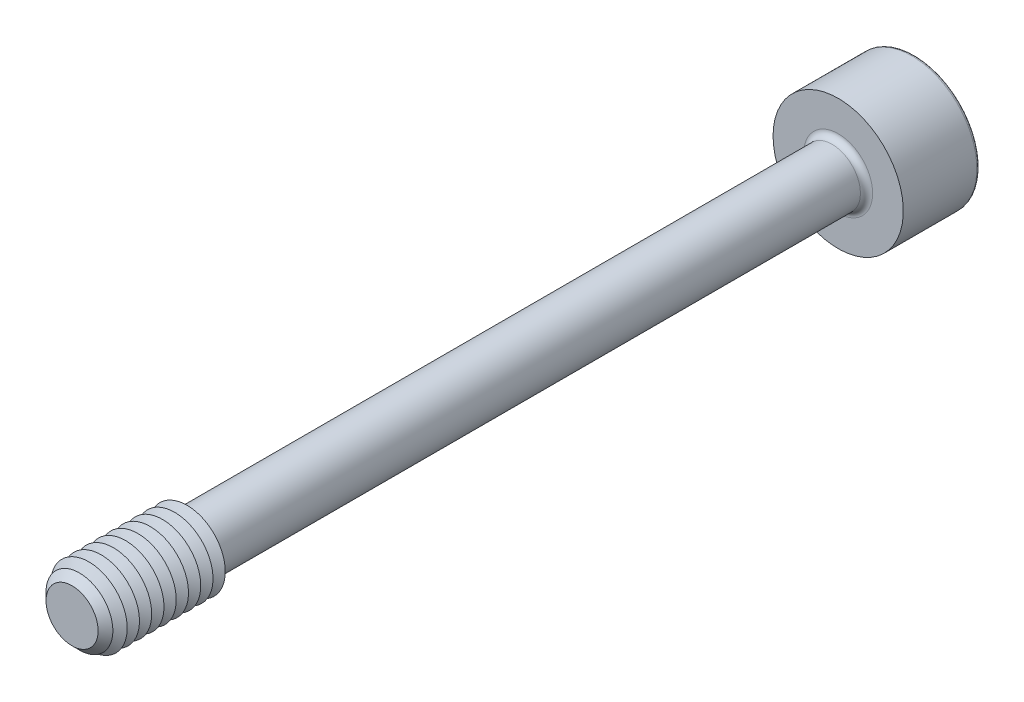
ISO-10303-21;
HEADER;
FILE_DESCRIPTION(('STEP AP214'),'2;1');
FILE_NAME('part.step','',(''),(''),'','','');
FILE_SCHEMA(('AUTOMOTIVE_DESIGN { 1 0 10303 214 1 1 1 1 }'));
ENDSEC;
DATA;
#1=APPLICATION_CONTEXT('core data for automotive mechanical design processes');
#2=APPLICATION_PROTOCOL_DEFINITION('international standard','automotive_design',2000,#1);
#3=PRODUCT_CONTEXT('',#1,'mechanical');
#4=PRODUCT('Part','Part','',(#3));
#5=PRODUCT_RELATED_PRODUCT_CATEGORY('part','',(#4));
#6=PRODUCT_DEFINITION_FORMATION('','',#4);
#7=PRODUCT_DEFINITION_CONTEXT('part definition',#1,'design');
#8=PRODUCT_DEFINITION('design','',#6,#7);
#9=PRODUCT_DEFINITION_SHAPE('','',#8);
#10=(LENGTH_UNIT() NAMED_UNIT(*) SI_UNIT(.MILLI.,.METRE.));
#11=(NAMED_UNIT(*) PLANE_ANGLE_UNIT() SI_UNIT($,.RADIAN.));
#12=(NAMED_UNIT(*) SI_UNIT($,.STERADIAN.) SOLID_ANGLE_UNIT());
#13=UNCERTAINTY_MEASURE_WITH_UNIT(LENGTH_MEASURE(1.E-05),#10,'distance_accuracy_value','');
#14=(GEOMETRIC_REPRESENTATION_CONTEXT(3) GLOBAL_UNCERTAINTY_ASSIGNED_CONTEXT((#13)) GLOBAL_UNIT_ASSIGNED_CONTEXT((#10,
#11,#12)) REPRESENTATION_CONTEXT('',''));
#15=CARTESIAN_POINT('',(0.,0.,0.));
#16=DIRECTION('',(0.,0.,1.));
#17=DIRECTION('',(1.,0.,0.));
#18=AXIS2_PLACEMENT_3D('',#15,#16,#17);
#19=CARTESIAN_POINT('',(-1.15470053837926,-2.,-26.));
#20=DIRECTION('',(0.,0.,1.));
#21=DIRECTION('',(1.,0.,0.));
#22=AXIS2_PLACEMENT_3D('',#19,#20,#21);
#23=PLANE('',#22);
#24=DIRECTION('',(1.,0.,0.));
#25=VECTOR('',#24,1.);
#26=CARTESIAN_POINT('',(-1.15470053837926,-2.,-26.));
#27=LINE('',#26,#25);
#28=CARTESIAN_POINT('',(0.,-2.,-26.));
#29=VERTEX_POINT('',#28);
#30=CARTESIAN_POINT('',(1.15470053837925,-2.,-26.));
#31=VERTEX_POINT('',#30);
#32=EDGE_CURVE('E796',#29,#31,#27,.T.);
#33=ORIENTED_EDGE('',*,*,#32,.F.);
#34=CARTESIAN_POINT('',(0.,0.,-26.));
#35=DIRECTION('',(0.,0.,1.));
#36=DIRECTION('',(0.,-1.,0.));
#37=AXIS2_PLACEMENT_3D('',#34,#35,#36);
#38=CIRCLE('',#37,2.);
#39=CARTESIAN_POINT('',(1.73205080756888,-0.999999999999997,-26.));
#40=VERTEX_POINT('',#39);
#41=EDGE_CURVE('E53',#29,#40,#38,.T.);
#42=ORIENTED_EDGE('',*,*,#41,.T.);
#43=DIRECTION('',(0.5,0.866025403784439,0.));
#44=VECTOR('',#43,1.);
#45=CARTESIAN_POINT('',(1.15470053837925,-2.,-26.));
#46=LINE('',#45,#44);
#47=EDGE_CURVE('E782',#31,#40,#46,.T.);
#48=ORIENTED_EDGE('',*,*,#47,.F.);
#49=EDGE_LOOP('',(#33,#42,#48));
#50=FACE_BOUND('',#49,.T.);
#51=ADVANCED_FACE('F41',(#50),#23,.F.);
#52=CARTESIAN_POINT('',(2.3094010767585,0.,-26.));
#53=VERTEX_POINT('',#52);
#54=EDGE_CURVE('E792',#40,#53,#46,.T.);
#55=ORIENTED_EDGE('',*,*,#54,.F.);
#56=CARTESIAN_POINT('',(1.73205080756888,1.,-26.));
#57=VERTEX_POINT('',#56);
#58=EDGE_CURVE('E11',#40,#57,#38,.T.);
#59=ORIENTED_EDGE('',*,*,#58,.T.);
#60=DIRECTION('',(-0.499999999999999,0.866025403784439,0.));
#61=VECTOR('',#60,1.);
#62=CARTESIAN_POINT('',(2.3094010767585,0.,-26.));
#63=LINE('',#62,#61);
#64=EDGE_CURVE('E781',#53,#57,#63,.T.);
#65=ORIENTED_EDGE('',*,*,#64,.F.);
#66=EDGE_LOOP('',(#55,#59,#65));
#67=FACE_BOUND('',#66,.T.);
#68=ADVANCED_FACE('F133',(#67),#23,.F.);
#69=CARTESIAN_POINT('',(1.15470053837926,2.,-26.));
#70=VERTEX_POINT('',#69);
#71=EDGE_CURVE('E776',#57,#70,#63,.T.);
#72=ORIENTED_EDGE('',*,*,#71,.F.);
#73=CARTESIAN_POINT('',(0.,2.00000000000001,-26.));
#74=VERTEX_POINT('',#73);
#75=EDGE_CURVE('E51',#57,#74,#38,.T.);
#76=ORIENTED_EDGE('',*,*,#75,.T.);
#77=DIRECTION('',(-1.,0.,0.));
#78=VECTOR('',#77,1.);
#79=CARTESIAN_POINT('',(1.15470053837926,2.,-26.));
#80=LINE('',#79,#78);
#81=EDGE_CURVE('E177',#70,#74,#80,.T.);
#82=ORIENTED_EDGE('',*,*,#81,.F.);
#83=EDGE_LOOP('',(#72,#76,#82));
#84=FACE_BOUND('',#83,.T.);
#85=ADVANCED_FACE('F139',(#84),#23,.F.);
#86=CARTESIAN_POINT('',(-1.15470053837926,2.,-26.));
#87=VERTEX_POINT('',#86);
#88=EDGE_CURVE('E787',#74,#87,#80,.T.);
#89=ORIENTED_EDGE('',*,*,#88,.F.);
#90=CARTESIAN_POINT('',(-1.73205080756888,1.00000000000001,-26.));
#91=VERTEX_POINT('',#90);
#92=EDGE_CURVE('E263',#74,#91,#38,.T.);
#93=ORIENTED_EDGE('',*,*,#92,.T.);
#94=DIRECTION('',(-0.5,-0.866025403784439,0.));
#95=VECTOR('',#94,1.);
#96=CARTESIAN_POINT('',(-1.15470053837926,2.,-26.));
#97=LINE('',#96,#95);
#98=EDGE_CURVE('E176',#87,#91,#97,.T.);
#99=ORIENTED_EDGE('',*,*,#98,.F.);
#100=EDGE_LOOP('',(#89,#93,#99));
#101=FACE_BOUND('',#100,.T.);
#102=ADVANCED_FACE('F157',(#101),#23,.F.);
#103=CARTESIAN_POINT('',(-2.30940107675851,0.,-26.));
#104=VERTEX_POINT('',#103);
#105=EDGE_CURVE('E170',#91,#104,#97,.T.);
#106=ORIENTED_EDGE('',*,*,#105,.F.);
#107=CARTESIAN_POINT('',(-1.73205080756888,-0.999999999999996,-26.));
#108=VERTEX_POINT('',#107);
#109=EDGE_CURVE('E172',#91,#108,#38,.T.);
#110=ORIENTED_EDGE('',*,*,#109,.T.);
#111=DIRECTION('',(0.5,-0.866025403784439,0.));
#112=VECTOR('',#111,1.);
#113=CARTESIAN_POINT('',(-2.30940107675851,0.,-26.));
#114=LINE('',#113,#112);
#115=EDGE_CURVE('E174',#104,#108,#114,.T.);
#116=ORIENTED_EDGE('',*,*,#115,.F.);
#117=EDGE_LOOP('',(#106,#110,#116));
#118=FACE_BOUND('',#117,.T.);
#119=ADVANCED_FACE('F146',(#118),#23,.F.);
#120=CARTESIAN_POINT('',(0.,0.,-30.));
#121=DIRECTION('',(0.,0.,-1.));
#122=DIRECTION('',(-1.,0.,0.));
#123=AXIS2_PLACEMENT_3D('',#120,#121,#122);
#124=PLANE('',#123);
#125=CARTESIAN_POINT('',(0.,0.,-30.));
#126=DIRECTION('',(0.,0.,-1.));
#127=DIRECTION('',(-1.,0.,0.));
#128=AXIS2_PLACEMENT_3D('',#125,#126,#127);
#129=CIRCLE('',#128,4.05);
#130=CARTESIAN_POINT('',(-4.05,0.,-30.));
#131=VERTEX_POINT('',#130);
#132=EDGE_CURVE('E249',#131,#131,#129,.T.);
#133=ORIENTED_EDGE('',*,*,#132,.T.);
#134=EDGE_LOOP('',(#133));
#135=FACE_BOUND('',#134,.T.);
#136=DIRECTION('',(-0.5,-0.866025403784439,0.));
#137=VECTOR('',#136,1.);
#138=CARTESIAN_POINT('',(-1.15470053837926,2.,-30.));
#139=LINE('',#138,#137);
#140=CARTESIAN_POINT('',(-1.15470053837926,2.,-30.));
#141=VERTEX_POINT('',#140);
#142=CARTESIAN_POINT('',(-2.30940107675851,0.,-30.));
#143=VERTEX_POINT('',#142);
#144=EDGE_CURVE('E211',#141,#143,#139,.T.);
#145=ORIENTED_EDGE('',*,*,#144,.T.);
#146=DIRECTION('',(0.5,-0.866025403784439,0.));
#147=VECTOR('',#146,1.);
#148=CARTESIAN_POINT('',(-2.30940107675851,0.,-30.));
#149=LINE('',#148,#147);
#150=CARTESIAN_POINT('',(-1.15470053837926,-2.,-30.));
#151=VERTEX_POINT('',#150);
#152=EDGE_CURVE('E67',#143,#151,#149,.T.);
#153=ORIENTED_EDGE('',*,*,#152,.T.);
#154=DIRECTION('',(1.,0.,0.));
#155=VECTOR('',#154,1.);
#156=CARTESIAN_POINT('',(-1.15470053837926,-2.,-30.));
#157=LINE('',#156,#155);
#158=CARTESIAN_POINT('',(1.15470053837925,-2.,-30.));
#159=VERTEX_POINT('',#158);
#160=EDGE_CURVE('E195',#151,#159,#157,.T.);
#161=ORIENTED_EDGE('',*,*,#160,.T.);
#162=DIRECTION('',(0.5,0.866025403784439,0.));
#163=VECTOR('',#162,1.);
#164=CARTESIAN_POINT('',(1.15470053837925,-2.,-30.));
#165=LINE('',#164,#163);
#166=CARTESIAN_POINT('',(2.3094010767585,0.,-30.));
#167=VERTEX_POINT('',#166);
#168=EDGE_CURVE('E199',#159,#167,#165,.T.);
#169=ORIENTED_EDGE('',*,*,#168,.T.);
#170=DIRECTION('',(-0.499999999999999,0.866025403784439,0.));
#171=VECTOR('',#170,1.);
#172=CARTESIAN_POINT('',(2.3094010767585,0.,-30.));
#173=LINE('',#172,#171);
#174=CARTESIAN_POINT('',(1.15470053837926,2.,-30.));
#175=VERTEX_POINT('',#174);
#176=EDGE_CURVE('E203',#167,#175,#173,.T.);
#177=ORIENTED_EDGE('',*,*,#176,.T.);
#178=DIRECTION('',(-1.,0.,0.));
#179=VECTOR('',#178,1.);
#180=CARTESIAN_POINT('',(1.15470053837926,2.,-30.));
#181=LINE('',#180,#179);
#182=EDGE_CURVE('E207',#175,#141,#181,.T.);
#183=ORIENTED_EDGE('',*,*,#182,.T.);
#184=EDGE_LOOP('',(#145,#153,#161,#169,#177,#183));
#185=FACE_BOUND('',#184,.T.);
#186=ADVANCED_FACE('F156',(#135,#185),#124,.T.);
#187=CARTESIAN_POINT('',(0.,0.,25.));
#188=DIRECTION('',(0.,0.,-1.));
#189=DIRECTION('',(-1.,0.,0.));
#190=AXIS2_PLACEMENT_3D('',#187,#188,#189);
#191=CYLINDRICAL_SURFACE('',#190,1.85);
#192=CARTESIAN_POINT('',(0.,0.,-24.6));
#193=DIRECTION('',(0.,0.,-1.));
#194=DIRECTION('',(-1.,0.,0.));
#195=AXIS2_PLACEMENT_3D('',#192,#193,#194);
#196=CIRCLE('',#195,1.85);
#197=CARTESIAN_POINT('',(-1.85,0.,-24.6));
#198=VERTEX_POINT('',#197);
#199=EDGE_CURVE('E245',#198,#198,#196,.F.);
#200=ORIENTED_EDGE('',*,*,#199,.T.);
#201=EDGE_LOOP('',(#200));
#202=FACE_BOUND('',#201,.T.);
#203=CARTESIAN_POINT('',(0.,0.,17.1247223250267));
#204=DIRECTION('',(0.,0.,-1.));
#205=DIRECTION('',(0.,1.,0.));
#206=AXIS2_PLACEMENT_3D('',#203,#204,#205);
#207=CIRCLE('',#206,1.85);
#208=CARTESIAN_POINT('',(0.,1.85,17.1247223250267));
#209=VERTEX_POINT('',#208);
#210=EDGE_CURVE('E233',#209,#209,#207,.T.);
#211=ORIENTED_EDGE('',*,*,#210,.T.);
#212=EDGE_LOOP('',(#211));
#213=FACE_BOUND('',#212,.T.);
#214=ADVANCED_FACE('F163',(#202,#213),#191,.T.);
#215=CARTESIAN_POINT('',(0.,0.,17.1247223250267));
#216=DIRECTION('',(0.,0.,1.));
#217=DIRECTION('',(0.,-1.,0.));
#218=AXIS2_PLACEMENT_3D('',#215,#216,#217);
#219=CONICAL_SURFACE('',#218,1.85,1.0471975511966);
#220=CARTESIAN_POINT('',(0.,0.,17.5));
#221=DIRECTION('',(0.,0.,-1.));
#222=DIRECTION('',(-1.,0.,0.));
#223=AXIS2_PLACEMENT_3D('',#220,#221,#222);
#224=CIRCLE('',#223,2.5);
#225=CARTESIAN_POINT('',(-2.5,0.,17.5));
#226=VERTEX_POINT('',#225);
#227=EDGE_CURVE('E267',#226,#226,#224,.T.);
#228=ORIENTED_EDGE('',*,*,#227,.T.);
#229=EDGE_LOOP('',(#228));
#230=FACE_BOUND('',#229,.T.);
#231=ORIENTED_EDGE('',*,*,#210,.F.);
#232=EDGE_LOOP('',(#231));
#233=FACE_BOUND('',#232,.T.);
#234=ADVANCED_FACE('F537',(#230,#233),#219,.T.);
#235=CARTESIAN_POINT('',(0.,0.,-25.));
#236=DIRECTION('',(0.,0.,-1.));
#237=DIRECTION('',(-1.,0.,0.));
#238=AXIS2_PLACEMENT_3D('',#235,#236,#237);
#239=PLANE('',#238);
#240=CARTESIAN_POINT('',(0.,0.,-25.));
#241=DIRECTION('',(0.,0.,-1.));
#242=DIRECTION('',(-1.,0.,0.));
#243=AXIS2_PLACEMENT_3D('',#240,#241,#242);
#244=CIRCLE('',#243,2.25);
#245=CARTESIAN_POINT('',(-2.25,0.,-25.));
#246=VERTEX_POINT('',#245);
#247=EDGE_CURVE('E241',#246,#246,#244,.T.);
#248=ORIENTED_EDGE('',*,*,#247,.T.);
#249=EDGE_LOOP('',(#248));
#250=FACE_BOUND('',#249,.T.);
#251=CARTESIAN_POINT('',(0.,0.,-25.));
#252=DIRECTION('',(0.,0.,-1.));
#253=DIRECTION('',(-1.,0.,0.));
#254=AXIS2_PLACEMENT_3D('',#251,#252,#253);
#255=CIRCLE('',#254,4.25);
#256=CARTESIAN_POINT('',(-4.25,0.,-25.));
#257=VERTEX_POINT('',#256);
#258=EDGE_CURVE('E229',#257,#257,#255,.T.);
#259=ORIENTED_EDGE('',*,*,#258,.F.);
#260=EDGE_LOOP('',(#259));
#261=FACE_BOUND('',#260,.T.);
#262=ADVANCED_FACE('F530',(#250,#261),#239,.F.);
#263=CARTESIAN_POINT('',(0.,0.,-30.));
#264=DIRECTION('',(0.,0.,1.));
#265=DIRECTION('',(1.,0.,0.));
#266=AXIS2_PLACEMENT_3D('',#263,#264,#265);
#267=CYLINDRICAL_SURFACE('',#266,4.25);
#268=CARTESIAN_POINT('',(0.,0.,-29.8));
#269=DIRECTION('',(0.,0.,-1.));
#270=DIRECTION('',(-1.,0.,0.));
#271=AXIS2_PLACEMENT_3D('',#268,#269,#270);
#272=CIRCLE('',#271,4.25);
#273=CARTESIAN_POINT('',(-4.25,0.,-29.8));
#274=VERTEX_POINT('',#273);
#275=EDGE_CURVE('E252',#274,#274,#272,.F.);
#276=ORIENTED_EDGE('',*,*,#275,.T.);
#277=EDGE_LOOP('',(#276));
#278=FACE_BOUND('',#277,.T.);
#279=ORIENTED_EDGE('',*,*,#258,.T.);
#280=EDGE_LOOP('',(#279));
#281=FACE_BOUND('',#280,.T.);
#282=ADVANCED_FACE('F536',(#278,#281),#267,.T.);
#283=CARTESIAN_POINT('',(-2.30940107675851,0.,-26.));
#284=DIRECTION('',(0.866025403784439,0.5,0.));
#285=DIRECTION('',(-0.5,0.866025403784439,0.));
#286=AXIS2_PLACEMENT_3D('',#283,#284,#285);
#287=PLANE('',#286);
#288=ORIENTED_EDGE('',*,*,#152,.F.);
#289=DIRECTION('',(0.,0.,-1.));
#290=VECTOR('',#289,1.);
#291=CARTESIAN_POINT('',(-2.30940107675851,0.,-26.));
#292=LINE('',#291,#290);
#293=EDGE_CURVE('E186',#104,#143,#292,.T.);
#294=ORIENTED_EDGE('',*,*,#293,.F.);
#295=ORIENTED_EDGE('',*,*,#115,.T.);
#296=CARTESIAN_POINT('',(-1.15470053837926,-2.,-26.));
#297=VERTEX_POINT('',#296);
#298=EDGE_CURVE('E214',#108,#297,#114,.T.);
#299=ORIENTED_EDGE('',*,*,#298,.T.);
#300=DIRECTION('',(0.,0.,-1.));
#301=VECTOR('',#300,1.);
#302=CARTESIAN_POINT('',(-1.15470053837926,-2.,-26.));
#303=LINE('',#302,#301);
#304=EDGE_CURVE('E226',#297,#151,#303,.T.);
#305=ORIENTED_EDGE('',*,*,#304,.T.);
#306=EDGE_LOOP('',(#288,#294,#295,#299,#305));
#307=FACE_BOUND('',#306,.T.);
#308=ADVANCED_FACE('F548',(#307),#287,.T.);
#309=CARTESIAN_POINT('',(-1.15470053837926,-2.,-26.));
#310=DIRECTION('',(0.,1.,0.));
#311=DIRECTION('',(-1.,0.,0.));
#312=AXIS2_PLACEMENT_3D('',#309,#310,#311);
#313=PLANE('',#312);
#314=ORIENTED_EDGE('',*,*,#160,.F.);
#315=ORIENTED_EDGE('',*,*,#304,.F.);
#316=EDGE_CURVE('E793',#297,#29,#27,.T.);
#317=ORIENTED_EDGE('',*,*,#316,.T.);
#318=ORIENTED_EDGE('',*,*,#32,.T.);
#319=DIRECTION('',(0.,0.,-1.));
#320=VECTOR('',#319,1.);
#321=CARTESIAN_POINT('',(1.15470053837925,-2.,-26.));
#322=LINE('',#321,#320);
#323=EDGE_CURVE('E223',#31,#159,#322,.T.);
#324=ORIENTED_EDGE('',*,*,#323,.T.);
#325=EDGE_LOOP('',(#314,#315,#317,#318,#324));
#326=FACE_BOUND('',#325,.T.);
#327=ADVANCED_FACE('F564',(#326),#313,.T.);
#328=CARTESIAN_POINT('',(1.15470053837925,-2.,-26.));
#329=DIRECTION('',(-0.866025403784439,0.5,0.));
#330=DIRECTION('',(-0.5,-0.866025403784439,0.));
#331=AXIS2_PLACEMENT_3D('',#328,#329,#330);
#332=PLANE('',#331);
#333=ORIENTED_EDGE('',*,*,#168,.F.);
#334=ORIENTED_EDGE('',*,*,#323,.F.);
#335=ORIENTED_EDGE('',*,*,#47,.T.);
#336=ORIENTED_EDGE('',*,*,#54,.T.);
#337=DIRECTION('',(0.,0.,-1.));
#338=VECTOR('',#337,1.);
#339=CARTESIAN_POINT('',(2.3094010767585,0.,-26.));
#340=LINE('',#339,#338);
#341=EDGE_CURVE('E220',#53,#167,#340,.T.);
#342=ORIENTED_EDGE('',*,*,#341,.T.);
#343=EDGE_LOOP('',(#333,#334,#335,#336,#342));
#344=FACE_BOUND('',#343,.T.);
#345=ADVANCED_FACE('F574',(#344),#332,.T.);
#346=CARTESIAN_POINT('',(2.3094010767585,0.,-26.));
#347=DIRECTION('',(-0.866025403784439,-0.499999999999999,0.));
#348=DIRECTION('',(0.499999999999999,-0.866025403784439,0.));
#349=AXIS2_PLACEMENT_3D('',#346,#347,#348);
#350=PLANE('',#349);
#351=ORIENTED_EDGE('',*,*,#176,.F.);
#352=ORIENTED_EDGE('',*,*,#341,.F.);
#353=ORIENTED_EDGE('',*,*,#64,.T.);
#354=ORIENTED_EDGE('',*,*,#71,.T.);
#355=DIRECTION('',(0.,0.,-1.));
#356=VECTOR('',#355,1.);
#357=CARTESIAN_POINT('',(1.15470053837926,2.,-26.));
#358=LINE('',#357,#356);
#359=EDGE_CURVE('E217',#70,#175,#358,.T.);
#360=ORIENTED_EDGE('',*,*,#359,.T.);
#361=EDGE_LOOP('',(#351,#352,#353,#354,#360));
#362=FACE_BOUND('',#361,.T.);
#363=ADVANCED_FACE('F584',(#362),#350,.T.);
#364=CARTESIAN_POINT('',(1.15470053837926,2.,-26.));
#365=DIRECTION('',(0.,-1.,0.));
#366=DIRECTION('',(0.,0.,-1.));
#367=AXIS2_PLACEMENT_3D('',#364,#365,#366);
#368=PLANE('',#367);
#369=ORIENTED_EDGE('',*,*,#182,.F.);
#370=ORIENTED_EDGE('',*,*,#359,.F.);
#371=ORIENTED_EDGE('',*,*,#81,.T.);
#372=ORIENTED_EDGE('',*,*,#88,.T.);
#373=DIRECTION('',(0.,0.,-1.));
#374=VECTOR('',#373,1.);
#375=CARTESIAN_POINT('',(-1.15470053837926,2.,-26.));
#376=LINE('',#375,#374);
#377=EDGE_CURVE('E182',#87,#141,#376,.T.);
#378=ORIENTED_EDGE('',*,*,#377,.T.);
#379=EDGE_LOOP('',(#369,#370,#371,#372,#378));
#380=FACE_BOUND('',#379,.T.);
#381=ADVANCED_FACE('F152',(#380),#368,.T.);
#382=CARTESIAN_POINT('',(-1.15470053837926,2.,-26.));
#383=DIRECTION('',(0.866025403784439,-0.5,0.));
#384=DIRECTION('',(0.5,0.866025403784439,0.));
#385=AXIS2_PLACEMENT_3D('',#382,#383,#384);
#386=PLANE('',#385);
#387=ORIENTED_EDGE('',*,*,#144,.F.);
#388=ORIENTED_EDGE('',*,*,#377,.F.);
#389=ORIENTED_EDGE('',*,*,#98,.T.);
#390=ORIENTED_EDGE('',*,*,#105,.T.);
#391=ORIENTED_EDGE('',*,*,#293,.T.);
#392=EDGE_LOOP('',(#387,#388,#389,#390,#391));
#393=FACE_BOUND('',#392,.T.);
#394=ADVANCED_FACE('F144',(#393),#386,.T.);
#395=ORIENTED_EDGE('',*,*,#298,.F.);
#396=EDGE_CURVE('E255',#108,#29,#38,.T.);
#397=ORIENTED_EDGE('',*,*,#396,.T.);
#398=ORIENTED_EDGE('',*,*,#316,.F.);
#399=EDGE_LOOP('',(#395,#397,#398));
#400=FACE_BOUND('',#399,.T.);
#401=ADVANCED_FACE('F135',(#400),#23,.F.);
#402=CARTESIAN_POINT('',(0.,0.,-24.6));
#403=DIRECTION('',(0.,0.,-1.));
#404=DIRECTION('',(-1.,0.,0.));
#405=AXIS2_PLACEMENT_3D('',#402,#403,#404);
#406=TOROIDAL_SURFACE('',#405,2.25,0.4);
#407=ORIENTED_EDGE('',*,*,#199,.F.);
#408=EDGE_LOOP('',(#407));
#409=FACE_BOUND('',#408,.T.);
#410=ORIENTED_EDGE('',*,*,#247,.F.);
#411=EDGE_LOOP('',(#410));
#412=FACE_BOUND('',#411,.T.);
#413=ADVANCED_FACE('F129',(#409,#412),#406,.F.);
#414=CARTESIAN_POINT('',(0.,0.,-29.8));
#415=DIRECTION('',(0.,0.,-1.));
#416=DIRECTION('',(-1.,0.,0.));
#417=AXIS2_PLACEMENT_3D('',#414,#415,#416);
#418=TOROIDAL_SURFACE('',#417,4.05,0.2);
#419=ORIENTED_EDGE('',*,*,#275,.F.);
#420=EDGE_LOOP('',(#419));
#421=FACE_BOUND('',#420,.T.);
#422=ORIENTED_EDGE('',*,*,#132,.F.);
#423=EDGE_LOOP('',(#422));
#424=FACE_BOUND('',#423,.T.);
#425=ADVANCED_FACE('F43',(#421,#424),#418,.T.);
#426=CARTESIAN_POINT('',(0.,0.,-24.8452994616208));
#427=DIRECTION('',(0.,0.,-1.));
#428=DIRECTION('',(0.,1.,0.));
#429=AXIS2_PLACEMENT_3D('',#426,#427,#428);
#430=CONICAL_SURFACE('',#429,0.,1.04719755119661);
#431=ORIENTED_EDGE('',*,*,#41,.F.);
#432=ORIENTED_EDGE('',*,*,#396,.F.);
#433=ORIENTED_EDGE('',*,*,#109,.F.);
#434=ORIENTED_EDGE('',*,*,#92,.F.);
#435=ORIENTED_EDGE('',*,*,#75,.F.);
#436=ORIENTED_EDGE('',*,*,#58,.F.);
#437=EDGE_LOOP('',(#431,#432,#433,#434,#435,#436));
#438=FACE_BOUND('',#437,.T.);
#439=CARTESIAN_POINT('',(0.,0.,-24.8452994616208));
#440=VERTEX_POINT('',#439);
#441=VERTEX_LOOP('',#440);
#442=FACE_BOUND('',#441,.T.);
#443=ADVANCED_FACE('F118',(#438,#442),#430,.F.);
#444=CARTESIAN_POINT('',(0.,0.,17.9));
#445=DIRECTION('',(0.,0.,-1.));
#446=DIRECTION('',(-1.,0.,0.));
#447=AXIS2_PLACEMENT_3D('',#444,#445,#446);
#448=CONICAL_SURFACE('',#447,1.80717967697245,1.0471975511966);
#449=ORIENTED_EDGE('',*,*,#227,.F.);
#450=EDGE_LOOP('',(#449));
#451=FACE_BOUND('',#450,.T.);
#452=CARTESIAN_POINT('',(0.,0.,17.9));
#453=DIRECTION('',(0.,0.,-1.));
#454=DIRECTION('',(-1.,0.,0.));
#455=AXIS2_PLACEMENT_3D('',#452,#453,#454);
#456=CIRCLE('',#455,1.80717967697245);
#457=CARTESIAN_POINT('',(-1.80717967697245,0.,17.9));
#458=VERTEX_POINT('',#457);
#459=EDGE_CURVE('E273',#458,#458,#456,.T.);
#460=ORIENTED_EDGE('',*,*,#459,.T.);
#461=EDGE_LOOP('',(#460));
#462=FACE_BOUND('',#461,.T.);
#463=ADVANCED_FACE('F120',(#451,#462),#448,.T.);
#464=CARTESIAN_POINT('',(0.,0.,18.3));
#465=DIRECTION('',(0.,0.,1.));
#466=DIRECTION('',(1.,0.,0.));
#467=AXIS2_PLACEMENT_3D('',#464,#465,#466);
#468=CONICAL_SURFACE('',#467,2.5,1.0471975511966);
#469=ORIENTED_EDGE('',*,*,#459,.F.);
#470=EDGE_LOOP('',(#469));
#471=FACE_BOUND('',#470,.T.);
#472=CARTESIAN_POINT('',(0.,0.,18.3));
#473=DIRECTION('',(0.,0.,-1.));
#474=DIRECTION('',(-1.,0.,0.));
#475=AXIS2_PLACEMENT_3D('',#472,#473,#474);
#476=CIRCLE('',#475,2.5);
#477=CARTESIAN_POINT('',(-2.5,0.,18.3));
#478=VERTEX_POINT('',#477);
#479=EDGE_CURVE('E280',#478,#478,#476,.T.);
#480=ORIENTED_EDGE('',*,*,#479,.T.);
#481=EDGE_LOOP('',(#480));
#482=FACE_BOUND('',#481,.T.);
#483=ADVANCED_FACE('F126',(#471,#482),#468,.T.);
#484=CARTESIAN_POINT('',(0.,0.,18.7));
#485=DIRECTION('',(0.,0.,-1.));
#486=DIRECTION('',(-1.,0.,0.));
#487=AXIS2_PLACEMENT_3D('',#484,#485,#486);
#488=CONICAL_SURFACE('',#487,1.80717967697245,1.0471975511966);
#489=ORIENTED_EDGE('',*,*,#479,.F.);
#490=EDGE_LOOP('',(#489));
#491=FACE_BOUND('',#490,.T.);
#492=CARTESIAN_POINT('',(0.,0.,18.7));
#493=DIRECTION('',(0.,0.,-1.));
#494=DIRECTION('',(-1.,0.,0.));
#495=AXIS2_PLACEMENT_3D('',#492,#493,#494);
#496=CIRCLE('',#495,1.80717967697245);
#497=CARTESIAN_POINT('',(-1.80717967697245,0.,18.7));
#498=VERTEX_POINT('',#497);
#499=EDGE_CURVE('E286',#498,#498,#496,.T.);
#500=ORIENTED_EDGE('',*,*,#499,.T.);
#501=EDGE_LOOP('',(#500));
#502=FACE_BOUND('',#501,.T.);
#503=ADVANCED_FACE('F414',(#491,#502),#488,.T.);
#504=CARTESIAN_POINT('',(0.,0.,19.1));
#505=DIRECTION('',(0.,0.,1.));
#506=DIRECTION('',(1.,0.,0.));
#507=AXIS2_PLACEMENT_3D('',#504,#505,#506);
#508=CONICAL_SURFACE('',#507,2.5,1.0471975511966);
#509=ORIENTED_EDGE('',*,*,#499,.F.);
#510=EDGE_LOOP('',(#509));
#511=FACE_BOUND('',#510,.T.);
#512=CARTESIAN_POINT('',(0.,0.,19.1));
#513=DIRECTION('',(0.,0.,-1.));
#514=DIRECTION('',(-1.,0.,0.));
#515=AXIS2_PLACEMENT_3D('',#512,#513,#514);
#516=CIRCLE('',#515,2.5);
#517=CARTESIAN_POINT('',(-2.5,0.,19.1));
#518=VERTEX_POINT('',#517);
#519=EDGE_CURVE('E290',#518,#518,#516,.T.);
#520=ORIENTED_EDGE('',*,*,#519,.T.);
#521=EDGE_LOOP('',(#520));
#522=FACE_BOUND('',#521,.T.);
#523=ADVANCED_FACE('F410',(#511,#522),#508,.T.);
#524=CARTESIAN_POINT('',(0.,0.,19.5));
#525=DIRECTION('',(0.,0.,-1.));
#526=DIRECTION('',(-1.,0.,0.));
#527=AXIS2_PLACEMENT_3D('',#524,#525,#526);
#528=CONICAL_SURFACE('',#527,1.80717967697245,1.0471975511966);
#529=ORIENTED_EDGE('',*,*,#519,.F.);
#530=EDGE_LOOP('',(#529));
#531=FACE_BOUND('',#530,.T.);
#532=CARTESIAN_POINT('',(0.,0.,19.5));
#533=DIRECTION('',(0.,0.,-1.));
#534=DIRECTION('',(-1.,0.,0.));
#535=AXIS2_PLACEMENT_3D('',#532,#533,#534);
#536=CIRCLE('',#535,1.80717967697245);
#537=CARTESIAN_POINT('',(-1.80717967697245,0.,19.5));
#538=VERTEX_POINT('',#537);
#539=EDGE_CURVE('E294',#538,#538,#536,.T.);
#540=ORIENTED_EDGE('',*,*,#539,.T.);
#541=EDGE_LOOP('',(#540));
#542=FACE_BOUND('',#541,.T.);
#543=ADVANCED_FACE('F406',(#531,#542),#528,.T.);
#544=CARTESIAN_POINT('',(0.,0.,19.9));
#545=DIRECTION('',(0.,0.,1.));
#546=DIRECTION('',(1.,0.,0.));
#547=AXIS2_PLACEMENT_3D('',#544,#545,#546);
#548=CONICAL_SURFACE('',#547,2.5,1.0471975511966);
#549=ORIENTED_EDGE('',*,*,#539,.F.);
#550=EDGE_LOOP('',(#549));
#551=FACE_BOUND('',#550,.T.);
#552=CARTESIAN_POINT('',(0.,0.,19.9));
#553=DIRECTION('',(0.,0.,-1.));
#554=DIRECTION('',(-1.,0.,0.));
#555=AXIS2_PLACEMENT_3D('',#552,#553,#554);
#556=CIRCLE('',#555,2.5);
#557=CARTESIAN_POINT('',(-2.5,0.,19.9));
#558=VERTEX_POINT('',#557);
#559=EDGE_CURVE('E298',#558,#558,#556,.T.);
#560=ORIENTED_EDGE('',*,*,#559,.T.);
#561=EDGE_LOOP('',(#560));
#562=FACE_BOUND('',#561,.T.);
#563=ADVANCED_FACE('F402',(#551,#562),#548,.T.);
#564=CARTESIAN_POINT('',(0.,0.,20.3));
#565=DIRECTION('',(0.,0.,-1.));
#566=DIRECTION('',(-1.,0.,0.));
#567=AXIS2_PLACEMENT_3D('',#564,#565,#566);
#568=CONICAL_SURFACE('',#567,1.80717967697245,1.0471975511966);
#569=ORIENTED_EDGE('',*,*,#559,.F.);
#570=EDGE_LOOP('',(#569));
#571=FACE_BOUND('',#570,.T.);
#572=CARTESIAN_POINT('',(0.,0.,20.3));
#573=DIRECTION('',(0.,0.,-1.));
#574=DIRECTION('',(-1.,0.,0.));
#575=AXIS2_PLACEMENT_3D('',#572,#573,#574);
#576=CIRCLE('',#575,1.80717967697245);
#577=CARTESIAN_POINT('',(-1.80717967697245,0.,20.3));
#578=VERTEX_POINT('',#577);
#579=EDGE_CURVE('E302',#578,#578,#576,.T.);
#580=ORIENTED_EDGE('',*,*,#579,.T.);
#581=EDGE_LOOP('',(#580));
#582=FACE_BOUND('',#581,.T.);
#583=ADVANCED_FACE('F398',(#571,#582),#568,.T.);
#584=CARTESIAN_POINT('',(0.,0.,20.7));
#585=DIRECTION('',(0.,0.,1.));
#586=DIRECTION('',(1.,0.,0.));
#587=AXIS2_PLACEMENT_3D('',#584,#585,#586);
#588=CONICAL_SURFACE('',#587,2.5,1.0471975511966);
#589=ORIENTED_EDGE('',*,*,#579,.F.);
#590=EDGE_LOOP('',(#589));
#591=FACE_BOUND('',#590,.T.);
#592=CARTESIAN_POINT('',(0.,0.,20.7));
#593=DIRECTION('',(0.,0.,-1.));
#594=DIRECTION('',(-1.,0.,0.));
#595=AXIS2_PLACEMENT_3D('',#592,#593,#594);
#596=CIRCLE('',#595,2.5);
#597=CARTESIAN_POINT('',(-2.5,0.,20.7));
#598=VERTEX_POINT('',#597);
#599=EDGE_CURVE('E306',#598,#598,#596,.T.);
#600=ORIENTED_EDGE('',*,*,#599,.T.);
#601=EDGE_LOOP('',(#600));
#602=FACE_BOUND('',#601,.T.);
#603=ADVANCED_FACE('F394',(#591,#602),#588,.T.);
#604=CARTESIAN_POINT('',(0.,0.,21.1));
#605=DIRECTION('',(0.,0.,-1.));
#606=DIRECTION('',(-1.,0.,0.));
#607=AXIS2_PLACEMENT_3D('',#604,#605,#606);
#608=CONICAL_SURFACE('',#607,1.80717967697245,1.0471975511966);
#609=ORIENTED_EDGE('',*,*,#599,.F.);
#610=EDGE_LOOP('',(#609));
#611=FACE_BOUND('',#610,.T.);
#612=CARTESIAN_POINT('',(0.,0.,21.1));
#613=DIRECTION('',(0.,0.,-1.));
#614=DIRECTION('',(-1.,0.,0.));
#615=AXIS2_PLACEMENT_3D('',#612,#613,#614);
#616=CIRCLE('',#615,1.80717967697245);
#617=CARTESIAN_POINT('',(-1.80717967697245,0.,21.1));
#618=VERTEX_POINT('',#617);
#619=EDGE_CURVE('E310',#618,#618,#616,.T.);
#620=ORIENTED_EDGE('',*,*,#619,.T.);
#621=EDGE_LOOP('',(#620));
#622=FACE_BOUND('',#621,.T.);
#623=ADVANCED_FACE('F390',(#611,#622),#608,.T.);
#624=CARTESIAN_POINT('',(0.,0.,21.5));
#625=DIRECTION('',(0.,0.,1.));
#626=DIRECTION('',(1.,0.,0.));
#627=AXIS2_PLACEMENT_3D('',#624,#625,#626);
#628=CONICAL_SURFACE('',#627,2.5,1.0471975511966);
#629=ORIENTED_EDGE('',*,*,#619,.F.);
#630=EDGE_LOOP('',(#629));
#631=FACE_BOUND('',#630,.T.);
#632=CARTESIAN_POINT('',(0.,0.,21.5));
#633=DIRECTION('',(0.,0.,-1.));
#634=DIRECTION('',(-1.,0.,0.));
#635=AXIS2_PLACEMENT_3D('',#632,#633,#634);
#636=CIRCLE('',#635,2.5);
#637=CARTESIAN_POINT('',(-2.5,0.,21.5));
#638=VERTEX_POINT('',#637);
#639=EDGE_CURVE('E314',#638,#638,#636,.T.);
#640=ORIENTED_EDGE('',*,*,#639,.T.);
#641=EDGE_LOOP('',(#640));
#642=FACE_BOUND('',#641,.T.);
#643=ADVANCED_FACE('F386',(#631,#642),#628,.T.);
#644=CARTESIAN_POINT('',(0.,0.,21.9));
#645=DIRECTION('',(0.,0.,-1.));
#646=DIRECTION('',(-1.,0.,0.));
#647=AXIS2_PLACEMENT_3D('',#644,#645,#646);
#648=CONICAL_SURFACE('',#647,1.80717967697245,1.0471975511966);
#649=ORIENTED_EDGE('',*,*,#639,.F.);
#650=EDGE_LOOP('',(#649));
#651=FACE_BOUND('',#650,.T.);
#652=CARTESIAN_POINT('',(0.,0.,21.9));
#653=DIRECTION('',(0.,0.,-1.));
#654=DIRECTION('',(-1.,0.,0.));
#655=AXIS2_PLACEMENT_3D('',#652,#653,#654);
#656=CIRCLE('',#655,1.80717967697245);
#657=CARTESIAN_POINT('',(-1.80717967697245,0.,21.9));
#658=VERTEX_POINT('',#657);
#659=EDGE_CURVE('E318',#658,#658,#656,.T.);
#660=ORIENTED_EDGE('',*,*,#659,.T.);
#661=EDGE_LOOP('',(#660));
#662=FACE_BOUND('',#661,.T.);
#663=ADVANCED_FACE('F382',(#651,#662),#648,.T.);
#664=CARTESIAN_POINT('',(0.,0.,22.3));
#665=DIRECTION('',(0.,0.,1.));
#666=DIRECTION('',(1.,0.,0.));
#667=AXIS2_PLACEMENT_3D('',#664,#665,#666);
#668=CONICAL_SURFACE('',#667,2.5,1.0471975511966);
#669=ORIENTED_EDGE('',*,*,#659,.F.);
#670=EDGE_LOOP('',(#669));
#671=FACE_BOUND('',#670,.T.);
#672=CARTESIAN_POINT('',(0.,0.,22.3));
#673=DIRECTION('',(0.,0.,-1.));
#674=DIRECTION('',(-1.,0.,0.));
#675=AXIS2_PLACEMENT_3D('',#672,#673,#674);
#676=CIRCLE('',#675,2.5);
#677=CARTESIAN_POINT('',(-2.5,0.,22.3));
#678=VERTEX_POINT('',#677);
#679=EDGE_CURVE('E322',#678,#678,#676,.T.);
#680=ORIENTED_EDGE('',*,*,#679,.T.);
#681=EDGE_LOOP('',(#680));
#682=FACE_BOUND('',#681,.T.);
#683=ADVANCED_FACE('F378',(#671,#682),#668,.T.);
#684=CARTESIAN_POINT('',(0.,0.,22.7));
#685=DIRECTION('',(0.,0.,-1.));
#686=DIRECTION('',(-1.,0.,0.));
#687=AXIS2_PLACEMENT_3D('',#684,#685,#686);
#688=CONICAL_SURFACE('',#687,1.80717967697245,1.0471975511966);
#689=ORIENTED_EDGE('',*,*,#679,.F.);
#690=EDGE_LOOP('',(#689));
#691=FACE_BOUND('',#690,.T.);
#692=CARTESIAN_POINT('',(0.,0.,22.7));
#693=DIRECTION('',(0.,0.,-1.));
#694=DIRECTION('',(-1.,0.,0.));
#695=AXIS2_PLACEMENT_3D('',#692,#693,#694);
#696=CIRCLE('',#695,1.80717967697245);
#697=CARTESIAN_POINT('',(-1.80717967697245,0.,22.7));
#698=VERTEX_POINT('',#697);
#699=EDGE_CURVE('E326',#698,#698,#696,.T.);
#700=ORIENTED_EDGE('',*,*,#699,.T.);
#701=EDGE_LOOP('',(#700));
#702=FACE_BOUND('',#701,.T.);
#703=ADVANCED_FACE('F374',(#691,#702),#688,.T.);
#704=CARTESIAN_POINT('',(0.,0.,23.1));
#705=DIRECTION('',(0.,0.,1.));
#706=DIRECTION('',(1.,0.,0.));
#707=AXIS2_PLACEMENT_3D('',#704,#705,#706);
#708=CONICAL_SURFACE('',#707,2.5,1.0471975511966);
#709=ORIENTED_EDGE('',*,*,#699,.F.);
#710=EDGE_LOOP('',(#709));
#711=FACE_BOUND('',#710,.T.);
#712=CARTESIAN_POINT('',(0.,0.,23.1));
#713=DIRECTION('',(0.,0.,-1.));
#714=DIRECTION('',(-1.,0.,0.));
#715=AXIS2_PLACEMENT_3D('',#712,#713,#714);
#716=CIRCLE('',#715,2.5);
#717=CARTESIAN_POINT('',(-2.5,0.,23.1));
#718=VERTEX_POINT('',#717);
#719=EDGE_CURVE('E329',#718,#718,#716,.T.);
#720=ORIENTED_EDGE('',*,*,#719,.T.);
#721=EDGE_LOOP('',(#720));
#722=FACE_BOUND('',#721,.T.);
#723=ADVANCED_FACE('F370',(#711,#722),#708,.T.);
#724=CARTESIAN_POINT('',(0.,0.,23.5));
#725=DIRECTION('',(0.,0.,-1.));
#726=DIRECTION('',(-1.,0.,0.));
#727=AXIS2_PLACEMENT_3D('',#724,#725,#726);
#728=CONICAL_SURFACE('',#727,1.80717967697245,1.0471975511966);
#729=ORIENTED_EDGE('',*,*,#719,.F.);
#730=EDGE_LOOP('',(#729));
#731=FACE_BOUND('',#730,.T.);
#732=CARTESIAN_POINT('',(0.,0.,23.5));
#733=DIRECTION('',(0.,0.,-1.));
#734=DIRECTION('',(-1.,0.,0.));
#735=AXIS2_PLACEMENT_3D('',#732,#733,#734);
#736=CIRCLE('',#735,1.80717967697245);
#737=CARTESIAN_POINT('',(-1.80717967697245,0.,23.5));
#738=VERTEX_POINT('',#737);
#739=EDGE_CURVE('E333',#738,#738,#736,.T.);
#740=ORIENTED_EDGE('',*,*,#739,.T.);
#741=EDGE_LOOP('',(#740));
#742=FACE_BOUND('',#741,.T.);
#743=ADVANCED_FACE('F366',(#731,#742),#728,.T.);
#744=CARTESIAN_POINT('',(0.,0.,23.9));
#745=DIRECTION('',(0.,0.,1.));
#746=DIRECTION('',(1.,0.,0.));
#747=AXIS2_PLACEMENT_3D('',#744,#745,#746);
#748=CONICAL_SURFACE('',#747,2.5,1.0471975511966);
#749=ORIENTED_EDGE('',*,*,#739,.F.);
#750=EDGE_LOOP('',(#749));
#751=FACE_BOUND('',#750,.T.);
#752=CARTESIAN_POINT('',(0.,0.,23.9));
#753=DIRECTION('',(0.,0.,-1.));
#754=DIRECTION('',(-1.,0.,0.));
#755=AXIS2_PLACEMENT_3D('',#752,#753,#754);
#756=CIRCLE('',#755,2.5);
#757=CARTESIAN_POINT('',(-2.5,0.,23.9));
#758=VERTEX_POINT('',#757);
#759=EDGE_CURVE('E337',#758,#758,#756,.T.);
#760=ORIENTED_EDGE('',*,*,#759,.T.);
#761=EDGE_LOOP('',(#760));
#762=FACE_BOUND('',#761,.T.);
#763=ADVANCED_FACE('F359',(#751,#762),#748,.T.);
#764=CARTESIAN_POINT('',(0.,0.,24.3));
#765=DIRECTION('',(0.,0.,-1.));
#766=DIRECTION('',(-1.,0.,0.));
#767=AXIS2_PLACEMENT_3D('',#764,#765,#766);
#768=CONICAL_SURFACE('',#767,1.80717967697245,1.0471975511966);
#769=ORIENTED_EDGE('',*,*,#759,.F.);
#770=EDGE_LOOP('',(#769));
#771=FACE_BOUND('',#770,.T.);
#772=CARTESIAN_POINT('',(0.,0.,24.3));
#773=DIRECTION('',(0.,0.,-1.));
#774=DIRECTION('',(-1.,0.,0.));
#775=AXIS2_PLACEMENT_3D('',#772,#773,#774);
#776=CIRCLE('',#775,1.80717967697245);
#777=CARTESIAN_POINT('',(-1.80717967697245,0.,24.3));
#778=VERTEX_POINT('',#777);
#779=EDGE_CURVE('E341',#778,#778,#776,.T.);
#780=ORIENTED_EDGE('',*,*,#779,.T.);
#781=EDGE_LOOP('',(#780));
#782=FACE_BOUND('',#781,.T.);
#783=ADVANCED_FACE('F345',(#771,#782),#768,.T.);
#784=CARTESIAN_POINT('',(0.,0.,24.7));
#785=DIRECTION('',(0.,0.,1.));
#786=DIRECTION('',(1.,0.,0.));
#787=AXIS2_PLACEMENT_3D('',#784,#785,#786);
#788=CONICAL_SURFACE('',#787,2.5,1.0471975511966);
#789=CARTESIAN_POINT('',(0.,0.,24.5169872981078));
#790=DIRECTION('',(0.,0.,1.));
#791=DIRECTION('',(1.,0.,0.));
#792=AXIS2_PLACEMENT_3D('',#789,#790,#791);
#793=CIRCLE('',#792,2.18301270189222);
#794=CARTESIAN_POINT('',(2.18301270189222,0.,24.5169872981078));
#795=VERTEX_POINT('',#794);
#796=EDGE_CURVE('E45',#795,#795,#793,.F.);
#797=ORIENTED_EDGE('',*,*,#796,.T.);
#798=EDGE_LOOP('',(#797));
#799=FACE_BOUND('',#798,.T.);
#800=ORIENTED_EDGE('',*,*,#779,.F.);
#801=EDGE_LOOP('',(#800));
#802=FACE_BOUND('',#801,.T.);
#803=ADVANCED_FACE('F347',(#799,#802),#788,.T.);
#804=CARTESIAN_POINT('',(0.,0.,25.));
#805=DIRECTION('',(0.,0.,1.));
#806=DIRECTION('',(1.,0.,0.));
#807=AXIS2_PLACEMENT_3D('',#804,#805,#806);
#808=PLANE('',#807);
#809=CARTESIAN_POINT('',(0.,0.,25.));
#810=DIRECTION('',(0.,0.,1.));
#811=DIRECTION('',(1.,0.,0.));
#812=AXIS2_PLACEMENT_3D('',#809,#810,#811);
#813=CIRCLE('',#812,1.7);
#814=CARTESIAN_POINT('',(1.7,0.,25.));
#815=VERTEX_POINT('',#814);
#816=EDGE_CURVE('E237',#815,#815,#813,.T.);
#817=ORIENTED_EDGE('',*,*,#816,.T.);
#818=EDGE_LOOP('',(#817));
#819=FACE_BOUND('',#818,.T.);
#820=ADVANCED_FACE('F349',(#819),#808,.T.);
#821=CARTESIAN_POINT('',(0.,0.,24.2));
#822=DIRECTION('',(0.,0.,-1.));
#823=DIRECTION('',(0.,1.,0.));
#824=AXIS2_PLACEMENT_3D('',#821,#822,#823);
#825=CONICAL_SURFACE('',#824,2.5,0.785398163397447);
#826=ORIENTED_EDGE('',*,*,#796,.F.);
#827=EDGE_LOOP('',(#826));
#828=FACE_BOUND('',#827,.T.);
#829=ORIENTED_EDGE('',*,*,#816,.F.);
#830=EDGE_LOOP('',(#829));
#831=FACE_BOUND('',#830,.T.);
#832=ADVANCED_FACE('F356',(#828,#831),#825,.T.);
#833=CLOSED_SHELL('',(#51,#68,#85,#102,#119,#186,#214,#234,#262,#282,#308,#327,#345,#363,#381,
#394,#401,#413,#425,#443,#463,#483,#503,#523,#543,#563,#583,#603,#623,#643,#663,#683,#703,#723,
#743,#763,#783,#803,#820,#832));
#834=MANIFOLD_SOLID_BREP('B2',#833);
#835=ADVANCED_BREP_SHAPE_REPRESENTATION('',(#18,#834),#14);
#836=SHAPE_DEFINITION_REPRESENTATION(#9,#835);
ENDSEC;
END-ISO-10303-21;
